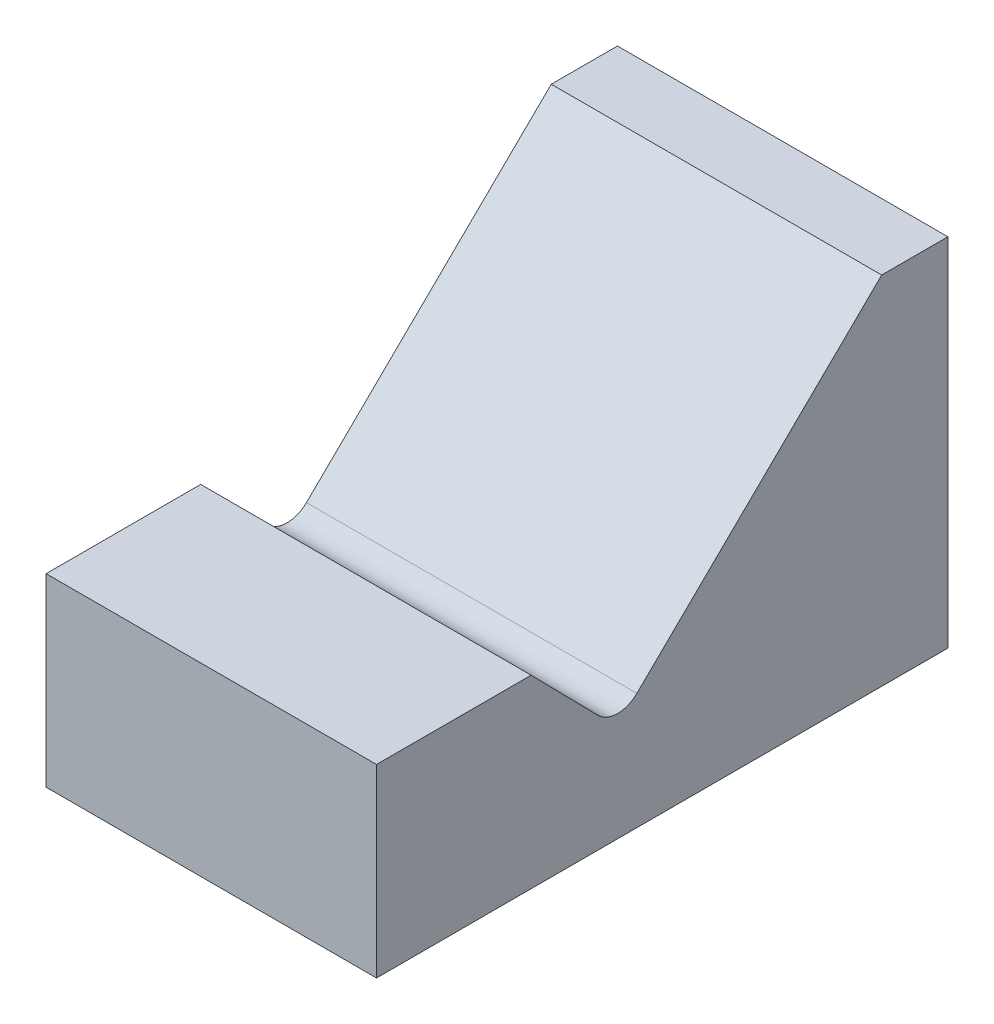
from build123d import *

# Parameters (mm, degrees)
BOSS_EXTRUDE1_DEPTH = 76.2


with BuildPart() as part:
    # Sketch1 → Boss-Extrude1 (new, symmetric)
    with BuildSketch(Plane(origin=(0, 0, 0), x_dir=(0, 0, -1), z_dir=(1, 0, 0))):
        with BuildLine():
            Line((0, 84.67191546), (0, -79.620153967))
            Line((0, -79.620153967), (-263.514555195, -79.620153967))
            Line((-263.514555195, -79.620153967), (-263.514555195, 5.676239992))
            Line((-263.514555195, 5.676239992), (-192.216951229, 5.676239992))
            Line((-192.216951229, 5.676239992), (-161.39742664, -25.777230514))
            ThreePointArc((-161.39742664, -25.777230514), (-152.455501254, -29.588196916), (-143.437844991, -25.960061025))
            Line((-143.437844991, -25.960061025), (-30.530210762, 84.67191546))
            Line((-30.530210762, 84.67191546), (0, 84.67191546))
        make_face()
    extrude(amount=BOSS_EXTRUDE1_DEPTH, both=True)


solid = part.part
